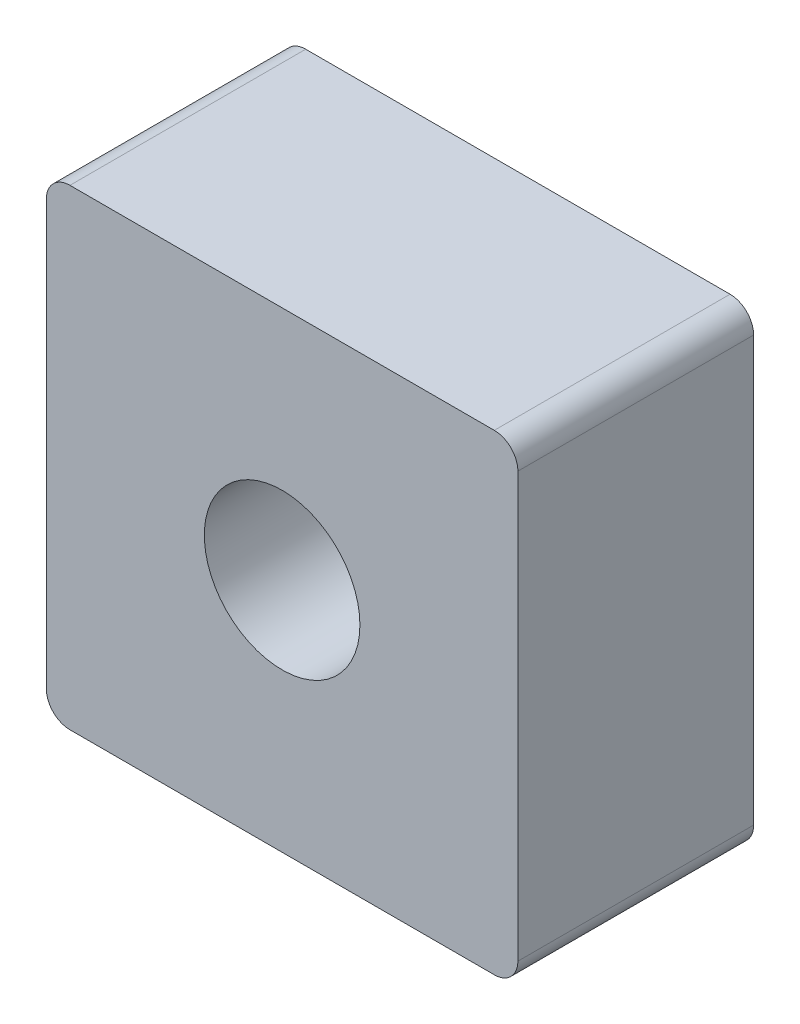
ISO-10303-21;
HEADER;
FILE_DESCRIPTION(('STEP AP214'),'2;1');
FILE_NAME('part.step','',(''),(''),'','','');
FILE_SCHEMA(('AUTOMOTIVE_DESIGN { 1 0 10303 214 1 1 1 1 }'));
ENDSEC;
DATA;
#1=APPLICATION_CONTEXT('core data for automotive mechanical design processes');
#2=APPLICATION_PROTOCOL_DEFINITION('international standard','automotive_design',2000,#1);
#3=PRODUCT_CONTEXT('',#1,'mechanical');
#4=PRODUCT('Part','Part','',(#3));
#5=PRODUCT_RELATED_PRODUCT_CATEGORY('part','',(#4));
#6=PRODUCT_DEFINITION_FORMATION('','',#4);
#7=PRODUCT_DEFINITION_CONTEXT('part definition',#1,'design');
#8=PRODUCT_DEFINITION('design','',#6,#7);
#9=PRODUCT_DEFINITION_SHAPE('','',#8);
#10=(LENGTH_UNIT() NAMED_UNIT(*) SI_UNIT(.MILLI.,.METRE.));
#11=(NAMED_UNIT(*) PLANE_ANGLE_UNIT() SI_UNIT($,.RADIAN.));
#12=(NAMED_UNIT(*) SI_UNIT($,.STERADIAN.) SOLID_ANGLE_UNIT());
#13=UNCERTAINTY_MEASURE_WITH_UNIT(LENGTH_MEASURE(1.E-05),#10,'distance_accuracy_value','');
#14=(GEOMETRIC_REPRESENTATION_CONTEXT(3) GLOBAL_UNCERTAINTY_ASSIGNED_CONTEXT((#13)) GLOBAL_UNIT_ASSIGNED_CONTEXT((#10,
#11,#12)) REPRESENTATION_CONTEXT('',''));
#15=CARTESIAN_POINT('',(0.,0.,0.));
#16=DIRECTION('',(0.,0.,1.));
#17=DIRECTION('',(1.,0.,0.));
#18=AXIS2_PLACEMENT_3D('',#15,#16,#17);
#19=CARTESIAN_POINT('',(-5.,5.,2.5));
#20=DIRECTION('',(1.,0.,0.));
#21=DIRECTION('',(0.,1.,0.));
#22=AXIS2_PLACEMENT_3D('',#19,#20,#21);
#23=PLANE('',#22);
#24=DIRECTION('',(0.,-1.,0.));
#25=VECTOR('',#24,1.);
#26=CARTESIAN_POINT('',(-5.,5.,2.5));
#27=LINE('',#26,#25);
#28=CARTESIAN_POINT('',(-5.,4.5,2.5));
#29=VERTEX_POINT('',#28);
#30=CARTESIAN_POINT('',(-5.,-4.5,2.5));
#31=VERTEX_POINT('',#30);
#32=EDGE_CURVE('E124',#29,#31,#27,.T.);
#33=ORIENTED_EDGE('',*,*,#32,.F.);
#34=DIRECTION('',(0.,0.,-1.));
#35=VECTOR('',#34,1.);
#36=CARTESIAN_POINT('',(-5.,4.5,2.5));
#37=LINE('',#36,#35);
#38=CARTESIAN_POINT('',(-5.,4.5,-2.5));
#39=VERTEX_POINT('',#38);
#40=EDGE_CURVE('E109',#29,#39,#37,.T.);
#41=ORIENTED_EDGE('',*,*,#40,.T.);
#42=DIRECTION('',(0.,-1.,0.));
#43=VECTOR('',#42,1.);
#44=CARTESIAN_POINT('',(-5.,5.,-2.5));
#45=LINE('',#44,#43);
#46=CARTESIAN_POINT('',(-5.,-4.5,-2.5));
#47=VERTEX_POINT('',#46);
#48=EDGE_CURVE('E121',#39,#47,#45,.T.);
#49=ORIENTED_EDGE('',*,*,#48,.T.);
#50=DIRECTION('',(0.,0.,-1.));
#51=VECTOR('',#50,1.);
#52=CARTESIAN_POINT('',(-5.,-4.5,2.5));
#53=LINE('',#52,#51);
#54=EDGE_CURVE('E126',#47,#31,#53,.F.);
#55=ORIENTED_EDGE('',*,*,#54,.T.);
#56=EDGE_LOOP('',(#33,#41,#49,#55));
#57=FACE_BOUND('',#56,.T.);
#58=ADVANCED_FACE('F39',(#57),#23,.F.);
#59=CARTESIAN_POINT('',(-5.,-5.,2.5));
#60=DIRECTION('',(0.,1.,0.));
#61=DIRECTION('',(0.,0.,1.));
#62=AXIS2_PLACEMENT_3D('',#59,#60,#61);
#63=PLANE('',#62);
#64=DIRECTION('',(1.,0.,0.));
#65=VECTOR('',#64,1.);
#66=CARTESIAN_POINT('',(-5.,-5.,2.5));
#67=LINE('',#66,#65);
#68=CARTESIAN_POINT('',(-4.5,-5.,2.5));
#69=VERTEX_POINT('',#68);
#70=CARTESIAN_POINT('',(4.5,-5.,2.5));
#71=VERTEX_POINT('',#70);
#72=EDGE_CURVE('E170',#69,#71,#67,.T.);
#73=ORIENTED_EDGE('',*,*,#72,.F.);
#74=DIRECTION('',(0.,0.,-1.));
#75=VECTOR('',#74,1.);
#76=CARTESIAN_POINT('',(-4.5,-5.,2.5));
#77=LINE('',#76,#75);
#78=CARTESIAN_POINT('',(-4.5,-5.,-2.5));
#79=VERTEX_POINT('',#78);
#80=EDGE_CURVE('E163',#69,#79,#77,.T.);
#81=ORIENTED_EDGE('',*,*,#80,.T.);
#82=DIRECTION('',(1.,0.,0.));
#83=VECTOR('',#82,1.);
#84=CARTESIAN_POINT('',(-5.,-5.,-2.5));
#85=LINE('',#84,#83);
#86=CARTESIAN_POINT('',(4.5,-5.,-2.5));
#87=VERTEX_POINT('',#86);
#88=EDGE_CURVE('E130',#79,#87,#85,.T.);
#89=ORIENTED_EDGE('',*,*,#88,.T.);
#90=DIRECTION('',(0.,0.,-1.));
#91=VECTOR('',#90,1.);
#92=CARTESIAN_POINT('',(4.5,-5.,2.5));
#93=LINE('',#92,#91);
#94=EDGE_CURVE('E161',#87,#71,#93,.F.);
#95=ORIENTED_EDGE('',*,*,#94,.T.);
#96=EDGE_LOOP('',(#73,#81,#89,#95));
#97=FACE_BOUND('',#96,.T.);
#98=ADVANCED_FACE('F168',(#97),#63,.F.);
#99=CARTESIAN_POINT('',(5.,5.,2.5));
#100=DIRECTION('',(-1.,0.,0.));
#101=DIRECTION('',(0.,-1.,0.));
#102=AXIS2_PLACEMENT_3D('',#99,#100,#101);
#103=PLANE('',#102);
#104=DIRECTION('',(0.,1.,0.));
#105=VECTOR('',#104,1.);
#106=CARTESIAN_POINT('',(5.,5.,2.5));
#107=LINE('',#106,#105);
#108=CARTESIAN_POINT('',(5.,-4.5,2.5));
#109=VERTEX_POINT('',#108);
#110=CARTESIAN_POINT('',(5.,4.5,2.5));
#111=VERTEX_POINT('',#110);
#112=EDGE_CURVE('E178',#109,#111,#107,.T.);
#113=ORIENTED_EDGE('',*,*,#112,.F.);
#114=DIRECTION('',(0.,0.,-1.));
#115=VECTOR('',#114,1.);
#116=CARTESIAN_POINT('',(5.,-4.5,2.5));
#117=LINE('',#116,#115);
#118=CARTESIAN_POINT('',(5.,-4.5,-2.5));
#119=VERTEX_POINT('',#118);
#120=EDGE_CURVE('E11',#109,#119,#117,.T.);
#121=ORIENTED_EDGE('',*,*,#120,.T.);
#122=DIRECTION('',(0.,1.,0.));
#123=VECTOR('',#122,1.);
#124=CARTESIAN_POINT('',(5.,5.,-2.5));
#125=LINE('',#124,#123);
#126=CARTESIAN_POINT('',(5.,4.5,-2.5));
#127=VERTEX_POINT('',#126);
#128=EDGE_CURVE('E134',#119,#127,#125,.T.);
#129=ORIENTED_EDGE('',*,*,#128,.T.);
#130=DIRECTION('',(0.,0.,-1.));
#131=VECTOR('',#130,1.);
#132=CARTESIAN_POINT('',(5.,4.5,2.5));
#133=LINE('',#132,#131);
#134=EDGE_CURVE('E47',#127,#111,#133,.F.);
#135=ORIENTED_EDGE('',*,*,#134,.T.);
#136=EDGE_LOOP('',(#113,#121,#129,#135));
#137=FACE_BOUND('',#136,.T.);
#138=ADVANCED_FACE('F177',(#137),#103,.F.);
#139=CARTESIAN_POINT('',(-5.,5.,2.5));
#140=DIRECTION('',(0.,-1.,0.));
#141=DIRECTION('',(1.,0.,0.));
#142=AXIS2_PLACEMENT_3D('',#139,#140,#141);
#143=PLANE('',#142);
#144=DIRECTION('',(-1.,0.,0.));
#145=VECTOR('',#144,1.);
#146=CARTESIAN_POINT('',(-5.,5.,-2.5));
#147=LINE('',#146,#145);
#148=CARTESIAN_POINT('',(4.5,5.,-2.5));
#149=VERTEX_POINT('',#148);
#150=CARTESIAN_POINT('',(-4.5,5.,-2.5));
#151=VERTEX_POINT('',#150);
#152=EDGE_CURVE('E144',#149,#151,#147,.T.);
#153=ORIENTED_EDGE('',*,*,#152,.T.);
#154=DIRECTION('',(0.,0.,-1.));
#155=VECTOR('',#154,1.);
#156=CARTESIAN_POINT('',(-4.5,5.,2.5));
#157=LINE('',#156,#155);
#158=CARTESIAN_POINT('',(-4.5,5.,2.5));
#159=VERTEX_POINT('',#158);
#160=EDGE_CURVE('E110',#151,#159,#157,.F.);
#161=ORIENTED_EDGE('',*,*,#160,.T.);
#162=DIRECTION('',(-1.,0.,0.));
#163=VECTOR('',#162,1.);
#164=CARTESIAN_POINT('',(-5.,5.,2.5));
#165=LINE('',#164,#163);
#166=CARTESIAN_POINT('',(4.5,5.,2.5));
#167=VERTEX_POINT('',#166);
#168=EDGE_CURVE('E140',#167,#159,#165,.T.);
#169=ORIENTED_EDGE('',*,*,#168,.F.);
#170=DIRECTION('',(0.,0.,-1.));
#171=VECTOR('',#170,1.);
#172=CARTESIAN_POINT('',(4.5,5.,2.5));
#173=LINE('',#172,#171);
#174=EDGE_CURVE('E115',#167,#149,#173,.T.);
#175=ORIENTED_EDGE('',*,*,#174,.T.);
#176=EDGE_LOOP('',(#153,#161,#169,#175));
#177=FACE_BOUND('',#176,.T.);
#178=ADVANCED_FACE('F191',(#177),#143,.F.);
#179=CARTESIAN_POINT('',(-5.,5.,2.5));
#180=DIRECTION('',(0.,0.,1.));
#181=DIRECTION('',(1.,0.,0.));
#182=AXIS2_PLACEMENT_3D('',#179,#180,#181);
#183=PLANE('',#182);
#184=CARTESIAN_POINT('',(0.,0.,2.5));
#185=DIRECTION('',(0.,0.,1.));
#186=DIRECTION('',(1.,0.,0.));
#187=AXIS2_PLACEMENT_3D('',#184,#185,#186);
#188=CIRCLE('',#187,1.65);
#189=CARTESIAN_POINT('',(1.65,0.,2.5));
#190=VERTEX_POINT('',#189);
#191=EDGE_CURVE('E137',#190,#190,#188,.T.);
#192=ORIENTED_EDGE('',*,*,#191,.F.);
#193=EDGE_LOOP('',(#192));
#194=FACE_BOUND('',#193,.T.);
#195=ORIENTED_EDGE('',*,*,#168,.T.);
#196=CARTESIAN_POINT('',(-4.5,4.5,2.5));
#197=DIRECTION('',(0.,0.,1.));
#198=DIRECTION('',(1.,0.,0.));
#199=AXIS2_PLACEMENT_3D('',#196,#197,#198);
#200=CIRCLE('',#199,0.5);
#201=EDGE_CURVE('E159',#159,#29,#200,.T.);
#202=ORIENTED_EDGE('',*,*,#201,.T.);
#203=ORIENTED_EDGE('',*,*,#32,.T.);
#204=CARTESIAN_POINT('',(-4.5,-4.5,2.5));
#205=DIRECTION('',(0.,0.,1.));
#206=DIRECTION('',(1.,0.,0.));
#207=AXIS2_PLACEMENT_3D('',#204,#205,#206);
#208=CIRCLE('',#207,0.5);
#209=EDGE_CURVE('E157',#31,#69,#208,.T.);
#210=ORIENTED_EDGE('',*,*,#209,.T.);
#211=ORIENTED_EDGE('',*,*,#72,.T.);
#212=CARTESIAN_POINT('',(4.5,-4.5,2.5));
#213=DIRECTION('',(0.,0.,1.));
#214=DIRECTION('',(1.,0.,0.));
#215=AXIS2_PLACEMENT_3D('',#212,#213,#214);
#216=CIRCLE('',#215,0.5);
#217=EDGE_CURVE('E60',#71,#109,#216,.T.);
#218=ORIENTED_EDGE('',*,*,#217,.T.);
#219=ORIENTED_EDGE('',*,*,#112,.T.);
#220=CARTESIAN_POINT('',(4.5,4.5,2.5));
#221=DIRECTION('',(0.,0.,1.));
#222=DIRECTION('',(1.,0.,0.));
#223=AXIS2_PLACEMENT_3D('',#220,#221,#222);
#224=CIRCLE('',#223,0.5);
#225=EDGE_CURVE('E154',#111,#167,#224,.T.);
#226=ORIENTED_EDGE('',*,*,#225,.T.);
#227=EDGE_LOOP('',(#195,#202,#203,#210,#211,#218,#219,#226));
#228=FACE_BOUND('',#227,.T.);
#229=ADVANCED_FACE('F189',(#194,#228),#183,.T.);
#230=CARTESIAN_POINT('',(-5.,5.,-2.5));
#231=DIRECTION('',(0.,0.,1.));
#232=DIRECTION('',(1.,0.,0.));
#233=AXIS2_PLACEMENT_3D('',#230,#231,#232);
#234=PLANE('',#233);
#235=CARTESIAN_POINT('',(0.,0.,-2.5));
#236=DIRECTION('',(0.,0.,1.));
#237=DIRECTION('',(1.,0.,0.));
#238=AXIS2_PLACEMENT_3D('',#235,#236,#237);
#239=CIRCLE('',#238,1.65);
#240=CARTESIAN_POINT('',(1.65,0.,-2.5));
#241=VERTEX_POINT('',#240);
#242=EDGE_CURVE('E131',#241,#241,#239,.T.);
#243=ORIENTED_EDGE('',*,*,#242,.T.);
#244=EDGE_LOOP('',(#243));
#245=FACE_BOUND('',#244,.T.);
#246=ORIENTED_EDGE('',*,*,#48,.F.);
#247=CARTESIAN_POINT('',(-4.5,4.5,-2.5));
#248=DIRECTION('',(0.,0.,1.));
#249=DIRECTION('',(1.,0.,0.));
#250=AXIS2_PLACEMENT_3D('',#247,#248,#249);
#251=CIRCLE('',#250,0.5);
#252=EDGE_CURVE('E105',#39,#151,#251,.F.);
#253=ORIENTED_EDGE('',*,*,#252,.T.);
#254=ORIENTED_EDGE('',*,*,#152,.F.);
#255=CARTESIAN_POINT('',(4.5,4.5,-2.5));
#256=DIRECTION('',(0.,0.,1.));
#257=DIRECTION('',(1.,0.,0.));
#258=AXIS2_PLACEMENT_3D('',#255,#256,#257);
#259=CIRCLE('',#258,0.5);
#260=EDGE_CURVE('E125',#149,#127,#259,.F.);
#261=ORIENTED_EDGE('',*,*,#260,.T.);
#262=ORIENTED_EDGE('',*,*,#128,.F.);
#263=CARTESIAN_POINT('',(4.5,-4.5,-2.5));
#264=DIRECTION('',(0.,0.,1.));
#265=DIRECTION('',(1.,0.,0.));
#266=AXIS2_PLACEMENT_3D('',#263,#264,#265);
#267=CIRCLE('',#266,0.5);
#268=EDGE_CURVE('E148',#119,#87,#267,.F.);
#269=ORIENTED_EDGE('',*,*,#268,.T.);
#270=ORIENTED_EDGE('',*,*,#88,.F.);
#271=CARTESIAN_POINT('',(-4.5,-4.5,-2.5));
#272=DIRECTION('',(0.,0.,1.));
#273=DIRECTION('',(1.,0.,0.));
#274=AXIS2_PLACEMENT_3D('',#271,#272,#273);
#275=CIRCLE('',#274,0.5);
#276=EDGE_CURVE('E116',#79,#47,#275,.F.);
#277=ORIENTED_EDGE('',*,*,#276,.T.);
#278=EDGE_LOOP('',(#246,#253,#254,#261,#262,#269,#270,#277));
#279=FACE_BOUND('',#278,.T.);
#280=ADVANCED_FACE('F128',(#245,#279),#234,.F.);
#281=CARTESIAN_POINT('',(0.,0.,2.5));
#282=DIRECTION('',(0.,0.,1.));
#283=DIRECTION('',(1.,0.,0.));
#284=AXIS2_PLACEMENT_3D('',#281,#282,#283);
#285=CYLINDRICAL_SURFACE('',#284,1.65);
#286=ORIENTED_EDGE('',*,*,#242,.F.);
#287=EDGE_LOOP('',(#286));
#288=FACE_BOUND('',#287,.T.);
#289=ORIENTED_EDGE('',*,*,#191,.T.);
#290=EDGE_LOOP('',(#289));
#291=FACE_BOUND('',#290,.T.);
#292=ADVANCED_FACE('F187',(#288,#291),#285,.F.);
#293=CARTESIAN_POINT('',(-4.5,4.5,2.5));
#294=DIRECTION('',(0.,0.,-1.));
#295=DIRECTION('',(-1.,0.,0.));
#296=AXIS2_PLACEMENT_3D('',#293,#294,#295);
#297=CYLINDRICAL_SURFACE('',#296,0.5);
#298=ORIENTED_EDGE('',*,*,#201,.F.);
#299=ORIENTED_EDGE('',*,*,#160,.F.);
#300=ORIENTED_EDGE('',*,*,#252,.F.);
#301=ORIENTED_EDGE('',*,*,#40,.F.);
#302=EDGE_LOOP('',(#298,#299,#300,#301));
#303=FACE_BOUND('',#302,.T.);
#304=ADVANCED_FACE('F108',(#303),#297,.T.);
#305=CARTESIAN_POINT('',(-4.5,-4.5,2.5));
#306=DIRECTION('',(0.,0.,-1.));
#307=DIRECTION('',(-1.,0.,0.));
#308=AXIS2_PLACEMENT_3D('',#305,#306,#307);
#309=CYLINDRICAL_SURFACE('',#308,0.5);
#310=ORIENTED_EDGE('',*,*,#209,.F.);
#311=ORIENTED_EDGE('',*,*,#54,.F.);
#312=ORIENTED_EDGE('',*,*,#276,.F.);
#313=ORIENTED_EDGE('',*,*,#80,.F.);
#314=EDGE_LOOP('',(#310,#311,#312,#313));
#315=FACE_BOUND('',#314,.T.);
#316=ADVANCED_FACE('F201',(#315),#309,.T.);
#317=CARTESIAN_POINT('',(4.5,-4.5,2.5));
#318=DIRECTION('',(0.,0.,-1.));
#319=DIRECTION('',(-1.,0.,0.));
#320=AXIS2_PLACEMENT_3D('',#317,#318,#319);
#321=CYLINDRICAL_SURFACE('',#320,0.5);
#322=ORIENTED_EDGE('',*,*,#217,.F.);
#323=ORIENTED_EDGE('',*,*,#94,.F.);
#324=ORIENTED_EDGE('',*,*,#268,.F.);
#325=ORIENTED_EDGE('',*,*,#120,.F.);
#326=EDGE_LOOP('',(#322,#323,#324,#325));
#327=FACE_BOUND('',#326,.T.);
#328=ADVANCED_FACE('F176',(#327),#321,.T.);
#329=CARTESIAN_POINT('',(4.5,4.5,2.5));
#330=DIRECTION('',(0.,0.,-1.));
#331=DIRECTION('',(-1.,0.,0.));
#332=AXIS2_PLACEMENT_3D('',#329,#330,#331);
#333=CYLINDRICAL_SURFACE('',#332,0.5);
#334=ORIENTED_EDGE('',*,*,#225,.F.);
#335=ORIENTED_EDGE('',*,*,#134,.F.);
#336=ORIENTED_EDGE('',*,*,#260,.F.);
#337=ORIENTED_EDGE('',*,*,#174,.F.);
#338=EDGE_LOOP('',(#334,#335,#336,#337));
#339=FACE_BOUND('',#338,.T.);
#340=ADVANCED_FACE('F41',(#339),#333,.T.);
#341=CLOSED_SHELL('',(#58,#98,#138,#178,#229,#280,#292,#304,#316,#328,#340));
#342=MANIFOLD_SOLID_BREP('B2',#341);
#343=ADVANCED_BREP_SHAPE_REPRESENTATION('',(#18,#342),#14);
#344=SHAPE_DEFINITION_REPRESENTATION(#9,#343);
ENDSEC;
END-ISO-10303-21;
